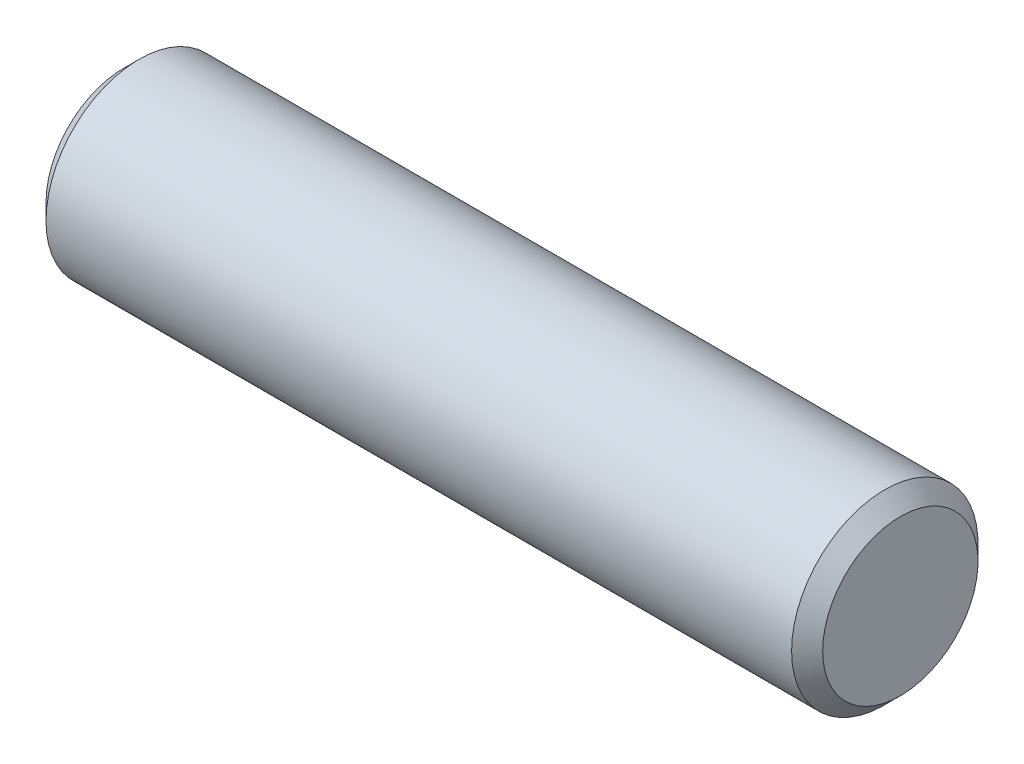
from build123d import *


with BuildPart() as part:
    # Esquisse2 → cylindre (revolve)
    with BuildSketch(Plane.XY, mode=Mode.PRIVATE) as cylindre_sk:
        Polygon((-12.5, 0), (12.5, 0), (12.5, 2.5), (12, 3), (-12, 3), (-12.5, 2.5), align=None)
    revolve(cylindre_sk.sketch.rotate(Axis((-48, 0, 0), (1, 0, 0)), 90), axis=Axis((-48, 0, 0), (1, 0, 0)))


solid = part.part
